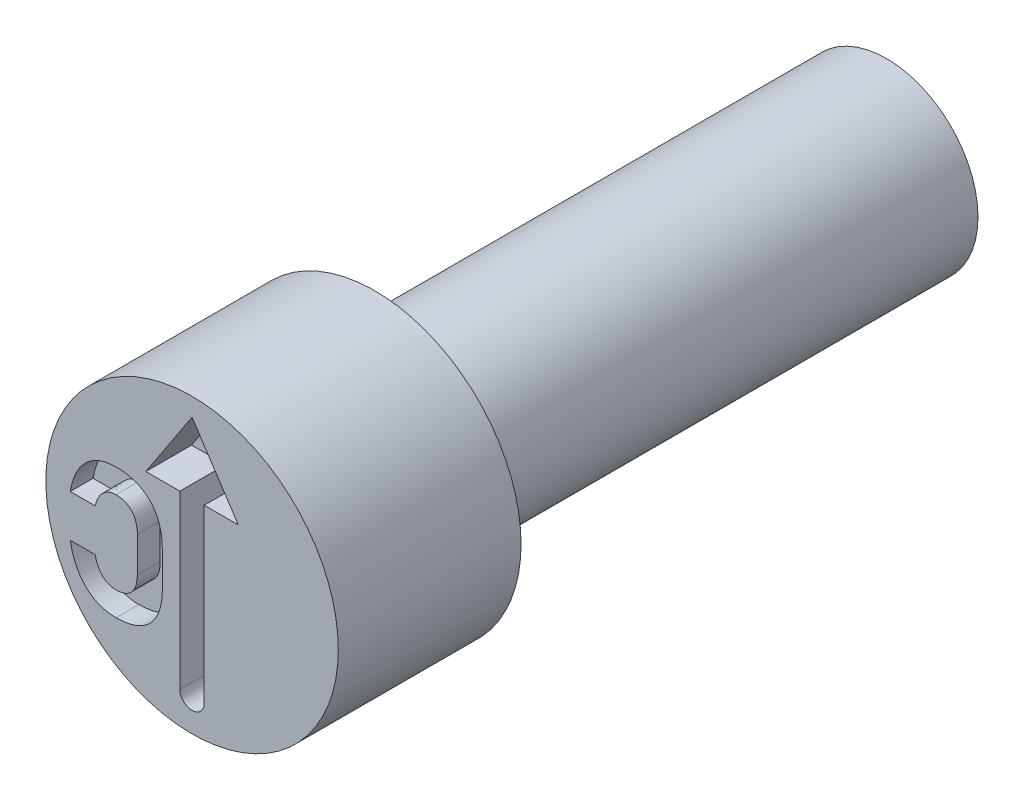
from build123d import *

# Parameters (mm, degrees)
CUT_EXTRUDE4_DEPTH = 0.25
CUT_EXTRUDE5_DEPTH = 0.125


with BuildPart() as part:
    # Sketch2 → Revolve1 (revolve)
    with BuildSketch(Plane(origin=(0, 0, 0), x_dir=(0, 0, -1), z_dir=(1, 0, 0)), mode=Mode.PRIVATE) as revolve1_sk:
        Polygon((0, 0.8), (0, 0), (3.8, 0), (3.8, 0.5), (1, 0.5), (1, 0.8), align=None)
    revolve(revolve1_sk.sketch.rotate(Axis((0, 0, -0.403888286), (0, 0, -1)), 90), axis=Axis((0, 0, -0.403888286), (0, 0, -1)))

    # Sketch3 → Cut-Extrude4 (cut)
    with BuildSketch(Plane.XY):
        with BuildLine():
            Line((0.066665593, 0.317223), (0.066665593, -0.621656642))
            ThreePointArc((0.066665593, -0.621656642), (0, -0.688322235), (-0.066665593, -0.621656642))
            Line((-0.066665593, -0.621656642), (-0.066665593, 0.317223))
            Line((-0.066665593, 0.317223), (-0.252671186, 0.317223))
            Line((-0.252671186, 0.317223), (0, 0.700740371))
            Line((0, 0.700740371), (0.252671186, 0.317223))
            Line((0.252671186, 0.317223), (0.066665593, 0.317223))
        make_face()
    extrude(amount=-CUT_EXTRUDE4_DEPTH, mode=Mode.SUBTRACT)

    # Sketch4 → Cut-Extrude5 (cut)
    with BuildSketch(Plane.XY):
        with BuildLine():
            add(Edge.make_bspline(
                [(-0.415834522, -0.457275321), (-0.409317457, -0.457204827), (-0.396457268, -0.457065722), (-0.377547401, -0.455618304), (-0.359304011, -0.453198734), (-0.341826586, -0.44978671), (-0.325066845, -0.445482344), (-0.308953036, -0.440394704), (-0.293640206, -0.434096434), (-0.278979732, -0.426954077), (-0.265178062, -0.418870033), (-0.252264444, -0.409777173), (-0.240110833, -0.39996079), (-0.228809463, -0.389224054), (-0.218372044, -0.3776297), (-0.208739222, -0.365164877), (-0.200108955, -0.351750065), (-0.192213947, -0.337566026), (-0.185189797, -0.322573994), (-0.179261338, -0.306702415), (-0.174121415, -0.290126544), (-0.1698218, -0.272849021), (-0.166529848, -0.254791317), (-0.164335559, -0.235967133), (-0.162814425, -0.216358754), (-0.162688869, -0.203022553), (-0.162624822, -0.196219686)],
                knots=[0, 0, 0, 0, 1.134237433, 2.238201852, 3.298772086, 4.336057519, 5.335809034, 6.309558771, 7.274828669, 8.21507465, 9.146315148, 10.055631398, 10.961815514, 11.863452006, 12.765999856, 13.674901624, 14.60241943, 15.539819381, 16.498894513, 17.481225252, 18.486546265, 19.518401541, 20.578551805, 21.679128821, 22.816111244, 24, 24, 24, 24], degree=3))
            Line((-0.162624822, -0.196219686), (-0.162624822, -0.004208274))
            add(Edge.make_bspline(
                [(-0.162624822, -0.004208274), (-0.162688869, 0.002594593), (-0.162814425, 0.015930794), (-0.164335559, 0.035539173), (-0.166529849, 0.054363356), (-0.169821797, 0.072421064), (-0.174121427, 0.089698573), (-0.179261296, 0.106274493), (-0.18518995, 0.122145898), (-0.192213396, 0.137138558), (-0.200110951, 0.15132032), (-0.208731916, 0.164743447), (-0.218420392, 0.177205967), (-0.228758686, 0.188936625), (-0.240117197, 0.199670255), (-0.252264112, 0.209490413), (-0.265172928, 0.21859594), (-0.279019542, 0.226634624), (-0.293595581, 0.234000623), (-0.308987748, 0.240199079), (-0.32503525, 0.245530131), (-0.341831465, 0.249772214), (-0.359302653, 0.253202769), (-0.377547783, 0.255617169), (-0.396457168, 0.25706602), (-0.409317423, 0.257204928), (-0.415834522, 0.257275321)],
                knots=[0, 0, 0, 0, 1.183277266, 2.319672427, 3.419680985, 4.479283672, 5.510605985, 6.515407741, 7.497231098, 8.455810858, 9.392726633, 10.319765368, 11.22819768, 12.136441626, 13.037612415, 13.943328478, 14.852175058, 15.782934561, 16.726365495, 17.691136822, 18.666946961, 19.666182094, 20.70293176, 21.7629542, 22.866348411, 24, 24, 24, 24], degree=3))
            add(Edge.make_bspline(
                [(-0.415834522, 0.257275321), (-0.426559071, 0.256988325), (-0.447581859, 0.256425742), (-0.478136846, 0.250777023), (-0.506990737, 0.241982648), (-0.533974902, 0.229442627), (-0.559004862, 0.213620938), (-0.581787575, 0.194370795), (-0.602315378, 0.171944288), (-0.620411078, 0.146249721), (-0.636126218, 0.117645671), (-0.64906352, 0.086128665), (-0.659564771, 0.051933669), (-0.664225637, 0.027941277), (-0.666619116, 0.015620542)],
                knots=[0, 0, 0, 0, 1.00806925, 1.976066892, 2.912865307, 3.839664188, 4.766819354, 5.690806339, 6.637604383, 7.619531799, 8.640729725, 9.701744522, 10.819784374, 12, 12, 12, 12], degree=3))
            Line((-0.666619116, 0.015620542), (-0.529957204, 0.015620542))
            add(Edge.make_bspline(
                [(-0.529957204, 0.015620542), (-0.528578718, 0.021212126), (-0.525896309, 0.032092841), (-0.520373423, 0.047571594), (-0.51409335, 0.06190908), (-0.506412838, 0.074763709), (-0.49805174, 0.08644584), (-0.488622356, 0.096566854), (-0.478331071, 0.10529464), (-0.467257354, 0.112513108), (-0.455431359, 0.118396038), (-0.442799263, 0.122289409), (-0.429535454, 0.124831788), (-0.420459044, 0.125155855), (-0.415834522, 0.12532097)],
                knots=[0, 0, 0, 0, 1.203096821, 2.341117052, 3.431111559, 4.469295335, 5.465369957, 6.42892467, 7.35290722, 8.279239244, 9.186115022, 10.104036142, 11.033987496, 12, 12, 12, 12], degree=3))
            add(Edge.make_bspline(
                [(-0.415834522, 0.12532097), (-0.409882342, 0.125112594), (-0.398388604, 0.124710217), (-0.381737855, 0.122088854), (-0.366570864, 0.117150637), (-0.352675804, 0.110599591), (-0.340263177, 0.102114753), (-0.329466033, 0.091713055), (-0.320278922, 0.079535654), (-0.31253747, 0.065792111), (-0.306551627, 0.050365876), (-0.302339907, 0.033447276), (-0.299733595, 0.015083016), (-0.299438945, 0.002362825), (-0.299286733, -0.004208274)],
                knots=[0, 0, 0, 0, 1.082677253, 2.090664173, 3.053339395, 3.973921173, 4.875832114, 5.774919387, 6.688160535, 7.640683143, 8.634736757, 9.687648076, 10.805466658, 12, 12, 12, 12], degree=3))
            Line((-0.299286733, -0.004208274), (-0.299286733, -0.196219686))
            add(Edge.make_bspline(
                [(-0.299286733, -0.196219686), (-0.299440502, -0.202790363), (-0.299738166, -0.215509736), (-0.302316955, -0.233833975), (-0.306583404, -0.250689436), (-0.31250262, -0.266047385), (-0.320277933, -0.279688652), (-0.329511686, -0.291723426), (-0.340257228, -0.302122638), (-0.35268135, -0.310583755), (-0.366541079, -0.31720213), (-0.381783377, -0.321854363), (-0.398367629, -0.324774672), (-0.4098779, -0.325134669), (-0.415834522, -0.32532097)],
                knots=[0, 0, 0, 0, 1.196920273, 2.316972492, 3.363591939, 4.359631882, 5.306515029, 6.214703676, 7.115587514, 8.019300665, 8.94172196, 9.903709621, 10.915159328, 12, 12, 12, 12], degree=3))
            add(Edge.make_bspline(
                [(-0.415834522, -0.32532097), (-0.420549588, -0.325135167), (-0.429797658, -0.324770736), (-0.443308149, -0.322539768), (-0.45602871, -0.318428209), (-0.468045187, -0.31288843), (-0.479269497, -0.305731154), (-0.489381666, -0.296887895), (-0.498800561, -0.28682165), (-0.507183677, -0.275204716), (-0.514614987, -0.26220473), (-0.520829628, -0.247816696), (-0.526224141, -0.23220085), (-0.528687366, -0.221166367), (-0.529957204, -0.215477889)],
                knots=[0, 0, 0, 0, 0.981077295, 1.924272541, 2.837745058, 3.753838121, 4.670304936, 5.59622504, 6.54113043, 7.532377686, 8.569122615, 9.649813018, 10.788435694, 12, 12, 12, 12], degree=3))
            Line((-0.529957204, -0.215477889), (-0.666619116, -0.215477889))
            add(Edge.make_bspline(
                [(-0.666619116, -0.215477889), (-0.664181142, -0.22784735), (-0.65944128, -0.25189583), (-0.648789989, -0.286142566), (-0.635664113, -0.317607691), (-0.620043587, -0.34624401), (-0.601833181, -0.371768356), (-0.581468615, -0.394276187), (-0.558777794, -0.413577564), (-0.533807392, -0.429478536), (-0.506845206, -0.441979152), (-0.478038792, -0.450758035), (-0.447536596, -0.456437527), (-0.426559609, -0.456991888), (-0.415834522, -0.457275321)],
                knots=[0, 0, 0, 0, 1.185884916, 2.305575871, 3.368634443, 4.390138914, 5.368714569, 6.312778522, 7.23993122, 8.163588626, 9.090665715, 10.027745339, 10.991628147, 12, 12, 12, 12], degree=3))
        make_face()
    extrude(amount=-CUT_EXTRUDE5_DEPTH, mode=Mode.SUBTRACT)


solid = part.part
